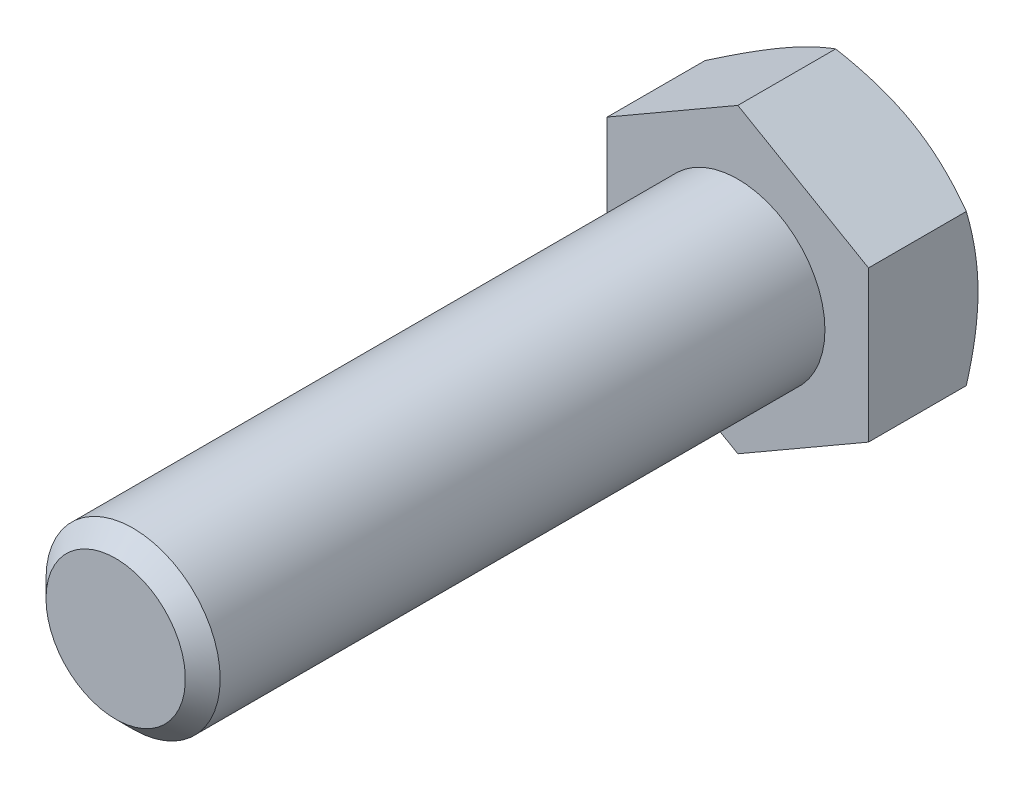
from build123d import *

# Parameters (mm, degrees)
ESQUISSE1_W        = 7
ESQUISSE1_H        = 50
CHANFREIN1_SIZE    = 1.4
BOSS_EXTRU_1_DEPTH = 8.8


with BuildPart() as part:
    # Esquisse1 → Base-R_volution (revolve)
    with BuildSketch(Plane(origin=(0, 0, 0), x_dir=(1, 0, 0), z_dir=(0, 1, 0))):
        with Locations((3.5, -25)):
            Rectangle(ESQUISSE1_W, ESQUISSE1_H)
    revolve(axis=Axis((0, 0, 0), (0, 0, 1)))

    # Chanfrein1
    chanfrein1_edges = [part.edges().sort_by_distance(p)[0] for p in [
        (-7, 0, 50),
    ]]
    chamfer(chanfrein1_edges, length=CHANFREIN1_SIZE)

    # Esquisse6 → Boss.-Extru.1 (add)
    with BuildSketch(Plane.XY):
        Polygon((10.5, -6.062177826), (10.5, 6.062177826), (0, 12.124355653), (-10.5, 6.062177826), (-10.5, -6.062177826), (0, -12.124355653), align=None)
    extrude(amount=-BOSS_EXTRU_1_DEPTH)

    # Esquisse7 → Enl_vement de mati_re-R_volution1 (revolve, cut)
    with BuildSketch(Plane(origin=(0, 0, 0), x_dir=(1, 0, 0), z_dir=(0, 1, 0))):
        Polygon((-10.5, 8.8), (-25.742047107, 8.8), (-25.742047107, 0), align=None)
    revolve(axis=Axis((0, 0, -6.239446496), (0, 0, 1)), mode=Mode.SUBTRACT)


solid = part.part
